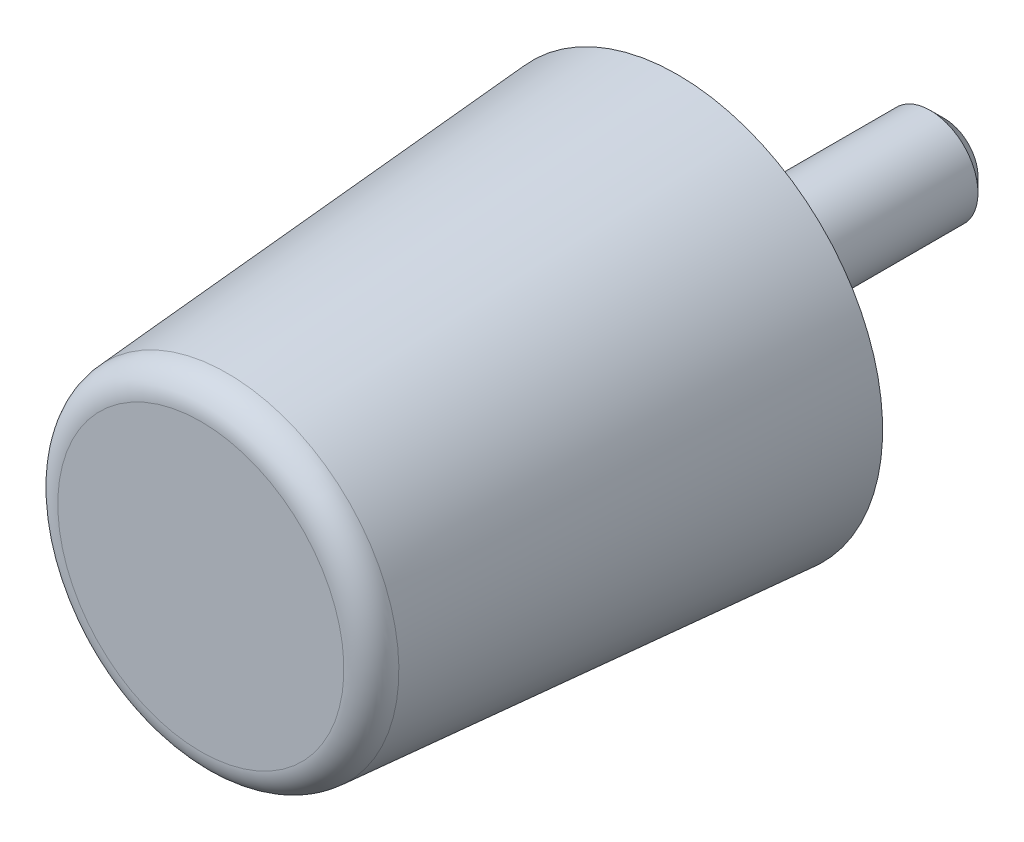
ISO-10303-21;
HEADER;
FILE_DESCRIPTION(('STEP AP214'),'2;1');
FILE_NAME('part.step','',(''),(''),'','','');
FILE_SCHEMA(('AUTOMOTIVE_DESIGN { 1 0 10303 214 1 1 1 1 }'));
ENDSEC;
DATA;
#1=APPLICATION_CONTEXT('core data for automotive mechanical design processes');
#2=APPLICATION_PROTOCOL_DEFINITION('international standard','automotive_design',2000,#1);
#3=PRODUCT_CONTEXT('',#1,'mechanical');
#4=PRODUCT('Part','Part','',(#3));
#5=PRODUCT_RELATED_PRODUCT_CATEGORY('part','',(#4));
#6=PRODUCT_DEFINITION_FORMATION('','',#4);
#7=PRODUCT_DEFINITION_CONTEXT('part definition',#1,'design');
#8=PRODUCT_DEFINITION('design','',#6,#7);
#9=PRODUCT_DEFINITION_SHAPE('','',#8);
#10=(LENGTH_UNIT() NAMED_UNIT(*) SI_UNIT(.MILLI.,.METRE.));
#11=(NAMED_UNIT(*) PLANE_ANGLE_UNIT() SI_UNIT($,.RADIAN.));
#12=(NAMED_UNIT(*) SI_UNIT($,.STERADIAN.) SOLID_ANGLE_UNIT());
#13=UNCERTAINTY_MEASURE_WITH_UNIT(LENGTH_MEASURE(1.E-05),#10,'distance_accuracy_value','');
#14=(GEOMETRIC_REPRESENTATION_CONTEXT(3) GLOBAL_UNCERTAINTY_ASSIGNED_CONTEXT((#13)) GLOBAL_UNIT_ASSIGNED_CONTEXT((#10,
#11,#12)) REPRESENTATION_CONTEXT('',''));
#15=CARTESIAN_POINT('',(0.,0.,0.));
#16=DIRECTION('',(0.,0.,1.));
#17=DIRECTION('',(1.,0.,0.));
#18=AXIS2_PLACEMENT_3D('',#15,#16,#17);
#19=CARTESIAN_POINT('',(0.,0.,50.));
#20=DIRECTION('',(0.,0.,1.));
#21=DIRECTION('',(0.,-1.,0.));
#22=AXIS2_PLACEMENT_3D('',#19,#20,#21);
#23=CYLINDRICAL_SURFACE('',#22,19.35);
#24=CARTESIAN_POINT('',(0.,0.,0.));
#25=DIRECTION('',(0.,0.,1.));
#26=DIRECTION('',(0.,-1.,0.));
#27=AXIS2_PLACEMENT_3D('',#24,#25,#26);
#28=CIRCLE('',#27,19.35);
#29=CARTESIAN_POINT('',(0.,-19.35,0.));
#30=VERTEX_POINT('',#29);
#31=EDGE_CURVE('E27',#30,#30,#28,.T.);
#32=ORIENTED_EDGE('',*,*,#31,.F.);
#33=EDGE_LOOP('',(#32));
#34=FACE_BOUND('',#33,.T.);
#35=CARTESIAN_POINT('',(0.,0.,0.0500000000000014));
#36=DIRECTION('',(0.,0.,1.));
#37=DIRECTION('',(0.,-1.,0.));
#38=AXIS2_PLACEMENT_3D('',#35,#36,#37);
#39=CIRCLE('',#38,19.35);
#40=CARTESIAN_POINT('',(0.,-19.35,0.0500000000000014));
#41=VERTEX_POINT('',#40);
#42=EDGE_CURVE('E44',#41,#41,#39,.T.);
#43=ORIENTED_EDGE('',*,*,#42,.T.);
#44=EDGE_LOOP('',(#43));
#45=FACE_BOUND('',#44,.T.);
#46=ADVANCED_FACE('F12',(#34,#45),#23,.F.);
#47=CARTESIAN_POINT('',(19.35,0.,0.));
#48=DIRECTION('',(0.,0.,1.));
#49=DIRECTION('',(0.,-1.,0.));
#50=AXIS2_PLACEMENT_3D('',#47,#48,#49);
#51=PLANE('',#50);
#52=CARTESIAN_POINT('',(0.,0.,0.));
#53=DIRECTION('',(0.,0.,1.));
#54=DIRECTION('',(0.,-1.,0.));
#55=AXIS2_PLACEMENT_3D('',#52,#53,#54);
#56=CIRCLE('',#55,21.5);
#57=CARTESIAN_POINT('',(0.,-21.5,0.));
#58=VERTEX_POINT('',#57);
#59=EDGE_CURVE('E32',#58,#58,#56,.T.);
#60=ORIENTED_EDGE('',*,*,#59,.F.);
#61=EDGE_LOOP('',(#60));
#62=FACE_BOUND('',#61,.T.);
#63=ORIENTED_EDGE('',*,*,#31,.T.);
#64=EDGE_LOOP('',(#63));
#65=FACE_BOUND('',#64,.T.);
#66=ADVANCED_FACE('F72',(#62,#65),#51,.F.);
#67=CARTESIAN_POINT('',(0.,0.,0.));
#68=DIRECTION('',(0.,0.,-1.));
#69=DIRECTION('',(0.,1.,0.));
#70=AXIS2_PLACEMENT_3D('',#67,#68,#69);
#71=CONICAL_SURFACE('',#70,21.5,0.0741559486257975);
#72=CARTESIAN_POINT('',(0.,0.,47.2222640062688));
#73=DIRECTION('',(0.,0.,1.));
#74=DIRECTION('',(0.,-1.,0.));
#75=AXIS2_PLACEMENT_3D('',#72,#73,#74);
#76=CIRCLE('',#75,17.9917551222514);
#77=CARTESIAN_POINT('',(0.,-17.9917551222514,47.2222640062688));
#78=VERTEX_POINT('',#77);
#79=EDGE_CURVE('E35',#78,#78,#76,.T.);
#80=ORIENTED_EDGE('',*,*,#79,.F.);
#81=EDGE_LOOP('',(#80));
#82=FACE_BOUND('',#81,.T.);
#83=ORIENTED_EDGE('',*,*,#59,.T.);
#84=EDGE_LOOP('',(#83));
#85=FACE_BOUND('',#84,.T.);
#86=ADVANCED_FACE('F77',(#82,#85),#71,.T.);
#87=CARTESIAN_POINT('',(0.,0.,47.));
#88=DIRECTION('',(0.,0.,1.));
#89=DIRECTION('',(0.,-1.,0.));
#90=AXIS2_PLACEMENT_3D('',#87,#88,#89);
#91=TOROIDAL_SURFACE('',#90,15.,3.);
#92=ORIENTED_EDGE('',*,*,#79,.T.);
#93=EDGE_LOOP('',(#92));
#94=FACE_BOUND('',#93,.T.);
#95=CARTESIAN_POINT('',(0.,0.,50.));
#96=DIRECTION('',(0.,0.,1.));
#97=DIRECTION('',(0.,-1.,0.));
#98=AXIS2_PLACEMENT_3D('',#95,#96,#97);
#99=CIRCLE('',#98,15.);
#100=CARTESIAN_POINT('',(0.,-15.,50.));
#101=VERTEX_POINT('',#100);
#102=EDGE_CURVE('E38',#101,#101,#99,.T.);
#103=ORIENTED_EDGE('',*,*,#102,.F.);
#104=EDGE_LOOP('',(#103));
#105=FACE_BOUND('',#104,.T.);
#106=ADVANCED_FACE('F84',(#94,#105),#91,.T.);
#107=CARTESIAN_POINT('',(15.,0.,50.));
#108=DIRECTION('',(0.,0.,-1.));
#109=DIRECTION('',(0.,1.,0.));
#110=AXIS2_PLACEMENT_3D('',#107,#108,#109);
#111=PLANE('',#110);
#112=ORIENTED_EDGE('',*,*,#102,.T.);
#113=EDGE_LOOP('',(#112));
#114=FACE_BOUND('',#113,.T.);
#115=ADVANCED_FACE('F59',(#114),#111,.F.);
#116=CARTESIAN_POINT('',(0.,0.,0.));
#117=DIRECTION('',(0.,0.,1.));
#118=DIRECTION('',(0.,-1.,0.));
#119=AXIS2_PLACEMENT_3D('',#116,#117,#118);
#120=PLANE('',#119);
#121=CARTESIAN_POINT('',(0.,0.,0.));
#122=DIRECTION('',(0.,0.,1.));
#123=DIRECTION('',(0.,-1.,0.));
#124=AXIS2_PLACEMENT_3D('',#121,#122,#123);
#125=CIRCLE('',#124,19.3);
#126=CARTESIAN_POINT('',(0.,-19.3,0.));
#127=VERTEX_POINT('',#126);
#128=EDGE_CURVE('E41',#127,#127,#125,.T.);
#129=ORIENTED_EDGE('',*,*,#128,.F.);
#130=EDGE_LOOP('',(#129));
#131=FACE_BOUND('',#130,.T.);
#132=CARTESIAN_POINT('',(0.,0.,0.));
#133=DIRECTION('',(0.,0.,1.));
#134=DIRECTION('',(0.,-1.,0.));
#135=AXIS2_PLACEMENT_3D('',#132,#133,#134);
#136=CIRCLE('',#135,5.);
#137=CARTESIAN_POINT('',(0.,-5.,0.));
#138=VERTEX_POINT('',#137);
#139=EDGE_CURVE('E23',#138,#138,#136,.T.);
#140=ORIENTED_EDGE('',*,*,#139,.T.);
#141=EDGE_LOOP('',(#140));
#142=FACE_BOUND('',#141,.T.);
#143=ADVANCED_FACE('F53',(#131,#142),#120,.F.);
#144=CARTESIAN_POINT('',(0.,0.,0.));
#145=DIRECTION('',(0.,0.,1.));
#146=DIRECTION('',(0.,-1.,0.));
#147=AXIS2_PLACEMENT_3D('',#144,#145,#146);
#148=CONICAL_SURFACE('',#147,19.3,0.785398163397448);
#149=ORIENTED_EDGE('',*,*,#42,.F.);
#150=EDGE_LOOP('',(#149));
#151=FACE_BOUND('',#150,.T.);
#152=ORIENTED_EDGE('',*,*,#128,.T.);
#153=EDGE_LOOP('',(#152));
#154=FACE_BOUND('',#153,.T.);
#155=ADVANCED_FACE('F49',(#151,#154),#148,.T.);
#156=CARTESIAN_POINT('',(0.,0.,50.));
#157=DIRECTION('',(0.,0.,1.));
#158=DIRECTION('',(0.,-1.,0.));
#159=AXIS2_PLACEMENT_3D('',#156,#157,#158);
#160=CYLINDRICAL_SURFACE('',#159,5.);
#161=CARTESIAN_POINT('',(0.,0.,-26.5));
#162=DIRECTION('',(0.,0.,-1.));
#163=DIRECTION('',(0.,1.,0.));
#164=AXIS2_PLACEMENT_3D('',#161,#162,#163);
#165=CIRCLE('',#164,5.);
#166=CARTESIAN_POINT('',(0.,5.,-26.5));
#167=VERTEX_POINT('',#166);
#168=EDGE_CURVE('E8',#167,#167,#165,.F.);
#169=ORIENTED_EDGE('',*,*,#168,.T.);
#170=EDGE_LOOP('',(#169));
#171=FACE_BOUND('',#170,.T.);
#172=ORIENTED_EDGE('',*,*,#139,.F.);
#173=EDGE_LOOP('',(#172));
#174=FACE_BOUND('',#173,.T.);
#175=ADVANCED_FACE('F52',(#171,#174),#160,.T.);
#176=CARTESIAN_POINT('',(0.,0.,-28.));
#177=DIRECTION('',(0.,0.,-1.));
#178=DIRECTION('',(0.,1.,0.));
#179=AXIS2_PLACEMENT_3D('',#176,#177,#178);
#180=PLANE('',#179);
#181=CARTESIAN_POINT('',(0.,0.,-28.));
#182=DIRECTION('',(0.,0.,-1.));
#183=DIRECTION('',(0.,1.,0.));
#184=AXIS2_PLACEMENT_3D('',#181,#182,#183);
#185=CIRCLE('',#184,3.5);
#186=CARTESIAN_POINT('',(0.,3.5,-28.));
#187=VERTEX_POINT('',#186);
#188=EDGE_CURVE('E19',#187,#187,#185,.T.);
#189=ORIENTED_EDGE('',*,*,#188,.T.);
#190=EDGE_LOOP('',(#189));
#191=FACE_BOUND('',#190,.T.);
#192=ADVANCED_FACE('F64',(#191),#180,.T.);
#193=CARTESIAN_POINT('',(0.,0.,-28.));
#194=DIRECTION('',(0.,0.,1.));
#195=DIRECTION('',(0.,-1.,0.));
#196=AXIS2_PLACEMENT_3D('',#193,#194,#195);
#197=CONICAL_SURFACE('',#196,3.5,0.785398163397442);
#198=ORIENTED_EDGE('',*,*,#168,.F.);
#199=EDGE_LOOP('',(#198));
#200=FACE_BOUND('',#199,.T.);
#201=ORIENTED_EDGE('',*,*,#188,.F.);
#202=EDGE_LOOP('',(#201));
#203=FACE_BOUND('',#202,.T.);
#204=ADVANCED_FACE('F14',(#200,#203),#197,.T.);
#205=CLOSED_SHELL('',(#46,#66,#86,#106,#115,#143,#155,#175,#192,#204));
#206=MANIFOLD_SOLID_BREP('B1',#205);
#207=ADVANCED_BREP_SHAPE_REPRESENTATION('',(#18,#206),#14);
#208=SHAPE_DEFINITION_REPRESENTATION(#9,#207);
ENDSEC;
END-ISO-10303-21;
